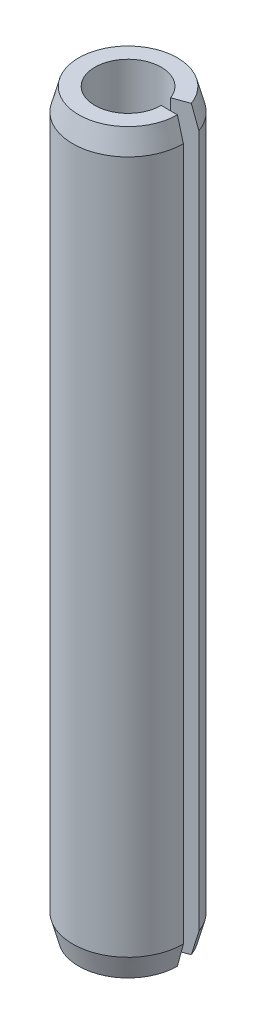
from build123d import *

# Parameters (mm, degrees)
BASE_R_VOLUTION_ANGLE = 340


with BuildPart() as part:
    # Esquisse3 → Base-R_volution (revolve)
    with BuildSketch(Plane.XY):
        Polygon((1.5, 0.6), (1.339230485, 0), (0.9, 0), (0.9, 20), (1.339230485, 20), (1.5, 19.4), align=None)
    revolve(axis=Axis((0, 20, 0), (0, -1, 0)), revolution_arc=BASE_R_VOLUTION_ANGLE)


solid = part.part
